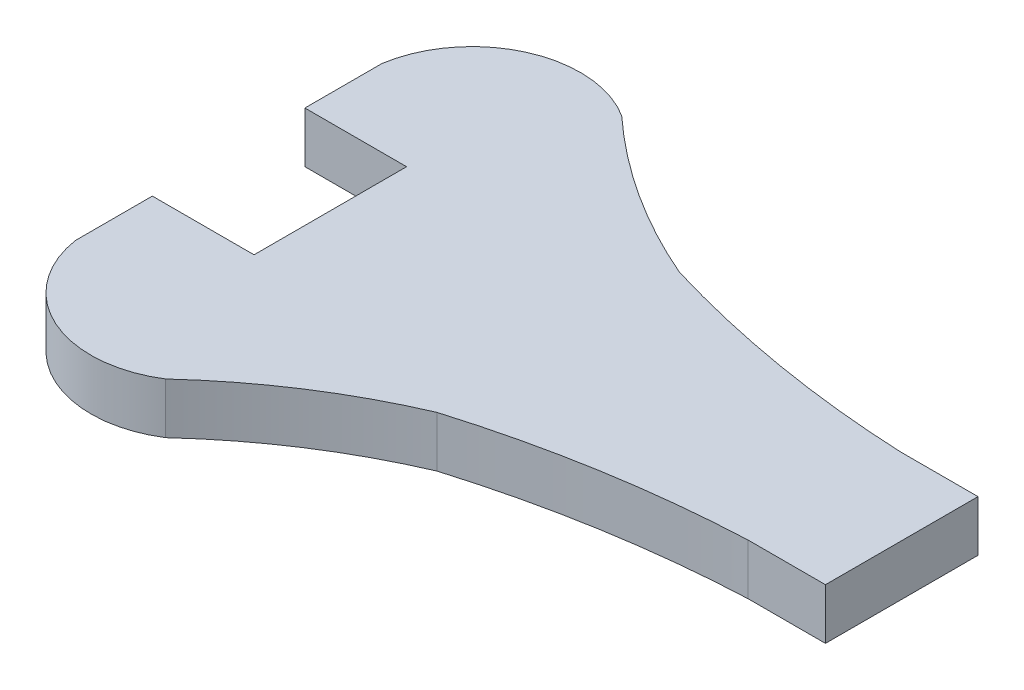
ISO-10303-21;
HEADER;
FILE_DESCRIPTION(('STEP AP214'),'2;1');
FILE_NAME('part.step','',(''),(''),'','','');
FILE_SCHEMA(('AUTOMOTIVE_DESIGN { 1 0 10303 214 1 1 1 1 }'));
ENDSEC;
DATA;
#1=APPLICATION_CONTEXT('core data for automotive mechanical design processes');
#2=APPLICATION_PROTOCOL_DEFINITION('international standard','automotive_design',2000,#1);
#3=PRODUCT_CONTEXT('',#1,'mechanical');
#4=PRODUCT('Part','Part','',(#3));
#5=PRODUCT_RELATED_PRODUCT_CATEGORY('part','',(#4));
#6=PRODUCT_DEFINITION_FORMATION('','',#4);
#7=PRODUCT_DEFINITION_CONTEXT('part definition',#1,'design');
#8=PRODUCT_DEFINITION('design','',#6,#7);
#9=PRODUCT_DEFINITION_SHAPE('','',#8);
#10=(LENGTH_UNIT() NAMED_UNIT(*) SI_UNIT(.MILLI.,.METRE.));
#11=(NAMED_UNIT(*) PLANE_ANGLE_UNIT() SI_UNIT($,.RADIAN.));
#12=(NAMED_UNIT(*) SI_UNIT($,.STERADIAN.) SOLID_ANGLE_UNIT());
#13=UNCERTAINTY_MEASURE_WITH_UNIT(LENGTH_MEASURE(1.E-05),#10,'distance_accuracy_value','');
#14=(GEOMETRIC_REPRESENTATION_CONTEXT(3) GLOBAL_UNCERTAINTY_ASSIGNED_CONTEXT((#13)) GLOBAL_UNIT_ASSIGNED_CONTEXT((#10,
#11,#12)) REPRESENTATION_CONTEXT('',''));
#15=CARTESIAN_POINT('',(0.,0.,0.));
#16=DIRECTION('',(0.,0.,1.));
#17=DIRECTION('',(1.,0.,0.));
#18=AXIS2_PLACEMENT_3D('',#15,#16,#17);
#19=CARTESIAN_POINT('',(13846.050556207,15.,-3171.60251170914));
#20=DIRECTION('',(0.,0.,-1.));
#21=DIRECTION('',(-1.,0.,0.));
#22=AXIS2_PLACEMENT_3D('',#19,#20,#21);
#23=PLANE('',#22);
#24=DIRECTION('',(1.,0.,0.));
#25=VECTOR('',#24,1.);
#26=CARTESIAN_POINT('',(13846.050556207,0.,-3171.60251170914));
#27=LINE('',#26,#25);
#28=CARTESIAN_POINT('',(13846.050556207,0.,-3171.60251170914));
#29=VERTEX_POINT('',#28);
#30=CARTESIAN_POINT('',(13876.050556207,0.,-3171.60251170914));
#31=VERTEX_POINT('',#30);
#32=EDGE_CURVE('E167',#29,#31,#27,.T.);
#33=ORIENTED_EDGE('',*,*,#32,.T.);
#34=DIRECTION('',(0.,-1.,0.));
#35=VECTOR('',#34,1.);
#36=CARTESIAN_POINT('',(13876.050556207,15.,-3171.60251170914));
#37=LINE('',#36,#35);
#38=CARTESIAN_POINT('',(13876.050556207,15.,-3171.60251170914));
#39=VERTEX_POINT('',#38);
#40=EDGE_CURVE('E11',#39,#31,#37,.T.);
#41=ORIENTED_EDGE('',*,*,#40,.F.);
#42=DIRECTION('',(1.,0.,0.));
#43=VECTOR('',#42,1.);
#44=CARTESIAN_POINT('',(13846.050556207,15.,-3171.60251170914));
#45=LINE('',#44,#43);
#46=CARTESIAN_POINT('',(13846.050556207,15.,-3171.60251170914));
#47=VERTEX_POINT('',#46);
#48=EDGE_CURVE('E193',#47,#39,#45,.T.);
#49=ORIENTED_EDGE('',*,*,#48,.F.);
#50=DIRECTION('',(0.,-1.,0.));
#51=VECTOR('',#50,1.);
#52=CARTESIAN_POINT('',(13846.050556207,15.,-3171.60251170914));
#53=LINE('',#52,#51);
#54=EDGE_CURVE('E163',#47,#29,#53,.T.);
#55=ORIENTED_EDGE('',*,*,#54,.T.);
#56=EDGE_LOOP('',(#33,#41,#49,#55));
#57=FACE_BOUND('',#56,.T.);
#58=ADVANCED_FACE('F35',(#57),#23,.F.);
#59=CARTESIAN_POINT('',(13876.050556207,15.,-3126.60251170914));
#60=DIRECTION('',(1.,0.,0.));
#61=DIRECTION('',(0.,0.,-1.));
#62=AXIS2_PLACEMENT_3D('',#59,#60,#61);
#63=PLANE('',#62);
#64=DIRECTION('',(0.,0.,1.));
#65=VECTOR('',#64,1.);
#66=CARTESIAN_POINT('',(13876.050556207,0.,-3126.60251170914));
#67=LINE('',#66,#65);
#68=CARTESIAN_POINT('',(13876.050556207,0.,-3126.60251170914));
#69=VERTEX_POINT('',#68);
#70=EDGE_CURVE('E170',#31,#69,#67,.T.);
#71=ORIENTED_EDGE('',*,*,#70,.T.);
#72=DIRECTION('',(0.,-1.,0.));
#73=VECTOR('',#72,1.);
#74=CARTESIAN_POINT('',(13876.050556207,15.,-3126.60251170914));
#75=LINE('',#74,#73);
#76=CARTESIAN_POINT('',(13876.050556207,15.,-3126.60251170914));
#77=VERTEX_POINT('',#76);
#78=EDGE_CURVE('E43',#77,#69,#75,.T.);
#79=ORIENTED_EDGE('',*,*,#78,.F.);
#80=DIRECTION('',(0.,0.,1.));
#81=VECTOR('',#80,1.);
#82=CARTESIAN_POINT('',(13876.050556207,15.,-3171.60251170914));
#83=LINE('',#82,#81);
#84=EDGE_CURVE('E112',#39,#77,#83,.T.);
#85=ORIENTED_EDGE('',*,*,#84,.F.);
#86=ORIENTED_EDGE('',*,*,#40,.T.);
#87=EDGE_LOOP('',(#71,#79,#85,#86));
#88=FACE_BOUND('',#87,.T.);
#89=ADVANCED_FACE('F281',(#88),#63,.F.);
#90=CARTESIAN_POINT('',(13846.050556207,15.,-3126.60251170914));
#91=DIRECTION('',(0.,0.,1.));
#92=DIRECTION('',(1.,0.,0.));
#93=AXIS2_PLACEMENT_3D('',#90,#91,#92);
#94=PLANE('',#93);
#95=DIRECTION('',(-1.,0.,0.));
#96=VECTOR('',#95,1.);
#97=CARTESIAN_POINT('',(13846.050556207,0.,-3126.60251170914));
#98=LINE('',#97,#96);
#99=CARTESIAN_POINT('',(13846.050556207,0.,-3126.60251170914));
#100=VERTEX_POINT('',#99);
#101=EDGE_CURVE('E172',#69,#100,#98,.T.);
#102=ORIENTED_EDGE('',*,*,#101,.T.);
#103=DIRECTION('',(0.,-1.,0.));
#104=VECTOR('',#103,1.);
#105=CARTESIAN_POINT('',(13846.050556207,15.,-3126.60251170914));
#106=LINE('',#105,#104);
#107=CARTESIAN_POINT('',(13846.050556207,15.,-3126.60251170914));
#108=VERTEX_POINT('',#107);
#109=EDGE_CURVE('E218',#108,#100,#106,.T.);
#110=ORIENTED_EDGE('',*,*,#109,.F.);
#111=DIRECTION('',(-1.,0.,0.));
#112=VECTOR('',#111,1.);
#113=CARTESIAN_POINT('',(13846.050556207,15.,-3126.60251170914));
#114=LINE('',#113,#112);
#115=EDGE_CURVE('E226',#77,#108,#114,.T.);
#116=ORIENTED_EDGE('',*,*,#115,.F.);
#117=ORIENTED_EDGE('',*,*,#78,.T.);
#118=EDGE_LOOP('',(#102,#110,#116,#117));
#119=FACE_BOUND('',#118,.T.);
#120=ADVANCED_FACE('F224',(#119),#94,.F.);
#121=CARTESIAN_POINT('',(13846.050556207,15.,-3126.60251170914));
#122=DIRECTION('',(1.,0.,0.));
#123=DIRECTION('',(0.,0.,-1.));
#124=AXIS2_PLACEMENT_3D('',#121,#122,#123);
#125=PLANE('',#124);
#126=DIRECTION('',(0.,0.,1.));
#127=VECTOR('',#126,1.);
#128=CARTESIAN_POINT('',(13846.050556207,0.,-3126.60251170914));
#129=LINE('',#128,#127);
#130=CARTESIAN_POINT('',(13846.050556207,0.,-3103.89129640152));
#131=VERTEX_POINT('',#130);
#132=EDGE_CURVE('E174',#100,#131,#129,.T.);
#133=ORIENTED_EDGE('',*,*,#132,.T.);
#134=DIRECTION('',(0.,-1.,0.));
#135=VECTOR('',#134,1.);
#136=CARTESIAN_POINT('',(13846.050556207,15.,-3103.89129640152));
#137=LINE('',#136,#135);
#138=CARTESIAN_POINT('',(13846.050556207,15.,-3103.89129640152));
#139=VERTEX_POINT('',#138);
#140=EDGE_CURVE('E215',#139,#131,#137,.T.);
#141=ORIENTED_EDGE('',*,*,#140,.F.);
#142=DIRECTION('',(0.,0.,1.));
#143=VECTOR('',#142,1.);
#144=CARTESIAN_POINT('',(13846.050556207,15.,-3126.60251170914));
#145=LINE('',#144,#143);
#146=EDGE_CURVE('E244',#108,#139,#145,.T.);
#147=ORIENTED_EDGE('',*,*,#146,.F.);
#148=ORIENTED_EDGE('',*,*,#109,.T.);
#149=EDGE_LOOP('',(#133,#141,#147,#148));
#150=FACE_BOUND('',#149,.T.);
#151=ADVANCED_FACE('F235',(#150),#125,.F.);
#152=CARTESIAN_POINT('',(13877.6260141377,15.,-3108.83569729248));
#153=DIRECTION('',(0.,-1.,0.));
#154=DIRECTION('',(0.,0.,-1.));
#155=AXIS2_PLACEMENT_3D('',#152,#153,#154);
#156=CYLINDRICAL_SURFACE('',#155,31.9602353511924);
#157=CARTESIAN_POINT('',(13877.6260141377,0.,-3108.83569729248));
#158=DIRECTION('',(0.,1.,0.));
#159=DIRECTION('',(0.,0.,1.));
#160=AXIS2_PLACEMENT_3D('',#157,#158,#159);
#161=CIRCLE('',#160,31.9602353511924);
#162=CARTESIAN_POINT('',(13894.7414302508,0.,-3081.84460292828));
#163=VERTEX_POINT('',#162);
#164=EDGE_CURVE('E176',#131,#163,#161,.T.);
#165=ORIENTED_EDGE('',*,*,#164,.T.);
#166=DIRECTION('',(0.,-1.,0.));
#167=VECTOR('',#166,1.);
#168=CARTESIAN_POINT('',(13894.7414302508,15.,-3081.84460292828));
#169=LINE('',#168,#167);
#170=CARTESIAN_POINT('',(13894.7414302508,15.,-3081.84460292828));
#171=VERTEX_POINT('',#170);
#172=EDGE_CURVE('E212',#171,#163,#169,.T.);
#173=ORIENTED_EDGE('',*,*,#172,.F.);
#174=CARTESIAN_POINT('',(13877.6260141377,15.,-3108.83569729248));
#175=DIRECTION('',(0.,1.,0.));
#176=DIRECTION('',(0.,0.,1.));
#177=AXIS2_PLACEMENT_3D('',#174,#175,#176);
#178=CIRCLE('',#177,31.9602353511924);
#179=EDGE_CURVE('E241',#139,#171,#178,.T.);
#180=ORIENTED_EDGE('',*,*,#179,.F.);
#181=ORIENTED_EDGE('',*,*,#140,.T.);
#182=EDGE_LOOP('',(#165,#173,#180,#181));
#183=FACE_BOUND('',#182,.T.);
#184=ADVANCED_FACE('F239',(#183),#156,.T.);
#185=CARTESIAN_POINT('',(14010.9900041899,15.,-2955.7284521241));
#186=DIRECTION('',(0.,-1.,0.));
#187=DIRECTION('',(0.,0.,-1.));
#188=AXIS2_PLACEMENT_3D('',#185,#186,#187);
#189=CYLINDRICAL_SURFACE('',#188,171.519720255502);
#190=CARTESIAN_POINT('',(14010.9900041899,0.,-2955.7284521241));
#191=DIRECTION('',(0.,-1.,0.));
#192=DIRECTION('',(0.,0.,1.));
#193=AXIS2_PLACEMENT_3D('',#190,#191,#192);
#194=CIRCLE('',#193,171.519720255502);
#195=CARTESIAN_POINT('',(13943.3010378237,0.,-3113.32673342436));
#196=VERTEX_POINT('',#195);
#197=EDGE_CURVE('E178',#163,#196,#194,.T.);
#198=ORIENTED_EDGE('',*,*,#197,.T.);
#199=DIRECTION('',(0.,-1.,0.));
#200=VECTOR('',#199,1.);
#201=CARTESIAN_POINT('',(13943.3010378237,15.,-3113.32673342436));
#202=LINE('',#201,#200);
#203=CARTESIAN_POINT('',(13943.3010378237,15.,-3113.32673342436));
#204=VERTEX_POINT('',#203);
#205=EDGE_CURVE('E209',#204,#196,#202,.T.);
#206=ORIENTED_EDGE('',*,*,#205,.F.);
#207=CARTESIAN_POINT('',(14010.9900041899,15.,-2955.7284521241));
#208=DIRECTION('',(0.,-1.,0.));
#209=DIRECTION('',(0.,0.,1.));
#210=AXIS2_PLACEMENT_3D('',#207,#208,#209);
#211=CIRCLE('',#210,171.519720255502);
#212=EDGE_CURVE('E243',#171,#204,#211,.T.);
#213=ORIENTED_EDGE('',*,*,#212,.F.);
#214=ORIENTED_EDGE('',*,*,#172,.T.);
#215=EDGE_LOOP('',(#198,#206,#213,#214));
#216=FACE_BOUND('',#215,.T.);
#217=ADVANCED_FACE('F294',(#216),#189,.F.);
#218=CARTESIAN_POINT('',(14036.0375291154,15.,-2803.75169070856));
#219=DIRECTION('',(0.,-1.,0.));
#220=DIRECTION('',(0.,0.,-1.));
#221=AXIS2_PLACEMENT_3D('',#218,#219,#220);
#222=CYLINDRICAL_SURFACE('',#221,323.166774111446);
#223=CARTESIAN_POINT('',(14036.0375291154,0.,-2803.75169070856));
#224=DIRECTION('',(0.,-1.,0.));
#225=DIRECTION('',(0.,0.,1.));
#226=AXIS2_PLACEMENT_3D('',#223,#224,#225);
#227=CIRCLE('',#226,323.166774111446);
#228=CARTESIAN_POINT('',(14021.7507776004,0.,-3126.60251170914));
#229=VERTEX_POINT('',#228);
#230=EDGE_CURVE('E180',#196,#229,#227,.T.);
#231=ORIENTED_EDGE('',*,*,#230,.T.);
#232=DIRECTION('',(0.,-1.,0.));
#233=VECTOR('',#232,1.);
#234=CARTESIAN_POINT('',(14021.7507776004,15.,-3126.60251170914));
#235=LINE('',#234,#233);
#236=CARTESIAN_POINT('',(14021.7507776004,15.,-3126.60251170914));
#237=VERTEX_POINT('',#236);
#238=EDGE_CURVE('E206',#237,#229,#235,.T.);
#239=ORIENTED_EDGE('',*,*,#238,.F.);
#240=CARTESIAN_POINT('',(14036.0375291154,15.,-2803.75169070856));
#241=DIRECTION('',(0.,-1.,0.));
#242=DIRECTION('',(0.,0.,1.));
#243=AXIS2_PLACEMENT_3D('',#240,#241,#242);
#244=CIRCLE('',#243,323.166774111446);
#245=EDGE_CURVE('E246',#204,#237,#244,.T.);
#246=ORIENTED_EDGE('',*,*,#245,.F.);
#247=ORIENTED_EDGE('',*,*,#205,.T.);
#248=EDGE_LOOP('',(#231,#239,#246,#247));
#249=FACE_BOUND('',#248,.T.);
#250=ADVANCED_FACE('F297',(#249),#222,.F.);
#251=CARTESIAN_POINT('',(14021.7507776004,15.,-3126.60251170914));
#252=DIRECTION('',(0.,0.,-1.));
#253=DIRECTION('',(-1.,0.,0.));
#254=AXIS2_PLACEMENT_3D('',#251,#252,#253);
#255=PLANE('',#254);
#256=DIRECTION('',(1.,0.,0.));
#257=VECTOR('',#256,1.);
#258=CARTESIAN_POINT('',(14021.7507776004,0.,-3126.60251170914));
#259=LINE('',#258,#257);
#260=CARTESIAN_POINT('',(14044.6104545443,0.,-3126.60251170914));
#261=VERTEX_POINT('',#260);
#262=EDGE_CURVE('E182',#229,#261,#259,.T.);
#263=ORIENTED_EDGE('',*,*,#262,.T.);
#264=DIRECTION('',(0.,-1.,0.));
#265=VECTOR('',#264,1.);
#266=CARTESIAN_POINT('',(14044.6104545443,15.,-3126.60251170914));
#267=LINE('',#266,#265);
#268=CARTESIAN_POINT('',(14044.6104545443,15.,-3126.60251170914));
#269=VERTEX_POINT('',#268);
#270=EDGE_CURVE('E203',#269,#261,#267,.T.);
#271=ORIENTED_EDGE('',*,*,#270,.F.);
#272=DIRECTION('',(1.,0.,0.));
#273=VECTOR('',#272,1.);
#274=CARTESIAN_POINT('',(14021.7507776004,15.,-3126.60251170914));
#275=LINE('',#274,#273);
#276=EDGE_CURVE('E252',#237,#269,#275,.T.);
#277=ORIENTED_EDGE('',*,*,#276,.F.);
#278=ORIENTED_EDGE('',*,*,#238,.T.);
#279=EDGE_LOOP('',(#263,#271,#277,#278));
#280=FACE_BOUND('',#279,.T.);
#281=ADVANCED_FACE('F301',(#280),#255,.F.);
#282=CARTESIAN_POINT('',(14044.6104545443,15.,-3171.60251170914));
#283=DIRECTION('',(-1.,0.,0.));
#284=DIRECTION('',(0.,0.,1.));
#285=AXIS2_PLACEMENT_3D('',#282,#283,#284);
#286=PLANE('',#285);
#287=DIRECTION('',(0.,0.,-1.));
#288=VECTOR('',#287,1.);
#289=CARTESIAN_POINT('',(14044.6104545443,0.,-3171.60251170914));
#290=LINE('',#289,#288);
#291=CARTESIAN_POINT('',(14044.6104545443,0.,-3171.60251170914));
#292=VERTEX_POINT('',#291);
#293=EDGE_CURVE('E184',#261,#292,#290,.T.);
#294=ORIENTED_EDGE('',*,*,#293,.T.);
#295=DIRECTION('',(0.,-1.,0.));
#296=VECTOR('',#295,1.);
#297=CARTESIAN_POINT('',(14044.6104545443,15.,-3171.60251170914));
#298=LINE('',#297,#296);
#299=CARTESIAN_POINT('',(14044.6104545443,15.,-3171.60251170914));
#300=VERTEX_POINT('',#299);
#301=EDGE_CURVE('E200',#300,#292,#298,.T.);
#302=ORIENTED_EDGE('',*,*,#301,.F.);
#303=DIRECTION('',(0.,0.,-1.));
#304=VECTOR('',#303,1.);
#305=CARTESIAN_POINT('',(14044.6104545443,15.,-3171.60251170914));
#306=LINE('',#305,#304);
#307=EDGE_CURVE('E254',#269,#300,#306,.T.);
#308=ORIENTED_EDGE('',*,*,#307,.F.);
#309=ORIENTED_EDGE('',*,*,#270,.T.);
#310=EDGE_LOOP('',(#294,#302,#308,#309));
#311=FACE_BOUND('',#310,.T.);
#312=ADVANCED_FACE('F305',(#311),#286,.F.);
#313=CARTESIAN_POINT('',(14021.7507776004,15.,-3171.60251170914));
#314=DIRECTION('',(0.,0.,1.));
#315=DIRECTION('',(1.,0.,0.));
#316=AXIS2_PLACEMENT_3D('',#313,#314,#315);
#317=PLANE('',#316);
#318=DIRECTION('',(-1.,0.,0.));
#319=VECTOR('',#318,1.);
#320=CARTESIAN_POINT('',(14021.7507776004,0.,-3171.60251170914));
#321=LINE('',#320,#319);
#322=CARTESIAN_POINT('',(14021.7507776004,0.,-3171.60251170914));
#323=VERTEX_POINT('',#322);
#324=EDGE_CURVE('E186',#292,#323,#321,.T.);
#325=ORIENTED_EDGE('',*,*,#324,.T.);
#326=DIRECTION('',(0.,-1.,0.));
#327=VECTOR('',#326,1.);
#328=CARTESIAN_POINT('',(14021.7507776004,15.,-3171.60251170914));
#329=LINE('',#328,#327);
#330=CARTESIAN_POINT('',(14021.7507776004,15.,-3171.60251170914));
#331=VERTEX_POINT('',#330);
#332=EDGE_CURVE('E197',#331,#323,#329,.T.);
#333=ORIENTED_EDGE('',*,*,#332,.F.);
#334=DIRECTION('',(-1.,0.,0.));
#335=VECTOR('',#334,1.);
#336=CARTESIAN_POINT('',(14021.7507776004,15.,-3171.60251170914));
#337=LINE('',#336,#335);
#338=EDGE_CURVE('E256',#300,#331,#337,.T.);
#339=ORIENTED_EDGE('',*,*,#338,.F.);
#340=ORIENTED_EDGE('',*,*,#301,.T.);
#341=EDGE_LOOP('',(#325,#333,#339,#340));
#342=FACE_BOUND('',#341,.T.);
#343=ADVANCED_FACE('F262',(#342),#317,.F.);
#344=CARTESIAN_POINT('',(14036.0375291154,15.,-3494.45333270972));
#345=DIRECTION('',(0.,-1.,0.));
#346=DIRECTION('',(0.,0.,-1.));
#347=AXIS2_PLACEMENT_3D('',#344,#345,#346);
#348=CYLINDRICAL_SURFACE('',#347,323.166774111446);
#349=CARTESIAN_POINT('',(14036.0375291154,0.,-3494.45333270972));
#350=DIRECTION('',(0.,-1.,0.));
#351=DIRECTION('',(0.,0.,1.));
#352=AXIS2_PLACEMENT_3D('',#349,#350,#351);
#353=CIRCLE('',#352,323.166774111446);
#354=CARTESIAN_POINT('',(13943.3010378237,0.,-3184.87828999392));
#355=VERTEX_POINT('',#354);
#356=EDGE_CURVE('E188',#323,#355,#353,.T.);
#357=ORIENTED_EDGE('',*,*,#356,.T.);
#358=DIRECTION('',(0.,-1.,0.));
#359=VECTOR('',#358,1.);
#360=CARTESIAN_POINT('',(13943.3010378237,15.,-3184.87828999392));
#361=LINE('',#360,#359);
#362=CARTESIAN_POINT('',(13943.3010378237,15.,-3184.87828999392));
#363=VERTEX_POINT('',#362);
#364=EDGE_CURVE('E158',#363,#355,#361,.T.);
#365=ORIENTED_EDGE('',*,*,#364,.F.);
#366=CARTESIAN_POINT('',(14036.0375291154,15.,-3494.45333270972));
#367=DIRECTION('',(0.,-1.,0.));
#368=DIRECTION('',(0.,0.,1.));
#369=AXIS2_PLACEMENT_3D('',#366,#367,#368);
#370=CIRCLE('',#369,323.166774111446);
#371=EDGE_CURVE('E149',#331,#363,#370,.T.);
#372=ORIENTED_EDGE('',*,*,#371,.F.);
#373=ORIENTED_EDGE('',*,*,#332,.T.);
#374=EDGE_LOOP('',(#357,#365,#372,#373));
#375=FACE_BOUND('',#374,.T.);
#376=ADVANCED_FACE('F266',(#375),#348,.F.);
#377=CARTESIAN_POINT('',(14010.9900041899,15.,-3342.47657129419));
#378=DIRECTION('',(0.,-1.,0.));
#379=DIRECTION('',(0.,0.,-1.));
#380=AXIS2_PLACEMENT_3D('',#377,#378,#379);
#381=CYLINDRICAL_SURFACE('',#380,171.519720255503);
#382=CARTESIAN_POINT('',(14010.9900041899,0.,-3342.47657129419));
#383=DIRECTION('',(0.,-1.,0.));
#384=DIRECTION('',(0.,0.,1.));
#385=AXIS2_PLACEMENT_3D('',#382,#383,#384);
#386=CIRCLE('',#385,171.519720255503);
#387=CARTESIAN_POINT('',(13894.7414302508,0.,-3216.36042049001));
#388=VERTEX_POINT('',#387);
#389=EDGE_CURVE('E157',#355,#388,#386,.T.);
#390=ORIENTED_EDGE('',*,*,#389,.T.);
#391=DIRECTION('',(0.,-1.,0.));
#392=VECTOR('',#391,1.);
#393=CARTESIAN_POINT('',(13894.7414302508,15.,-3216.36042049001));
#394=LINE('',#393,#392);
#395=CARTESIAN_POINT('',(13894.7414302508,15.,-3216.36042049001));
#396=VERTEX_POINT('',#395);
#397=EDGE_CURVE('E154',#396,#388,#394,.T.);
#398=ORIENTED_EDGE('',*,*,#397,.F.);
#399=CARTESIAN_POINT('',(14010.9900041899,15.,-3342.47657129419));
#400=DIRECTION('',(0.,-1.,0.));
#401=DIRECTION('',(0.,0.,1.));
#402=AXIS2_PLACEMENT_3D('',#399,#400,#401);
#403=CIRCLE('',#402,171.519720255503);
#404=EDGE_CURVE('E143',#363,#396,#403,.T.);
#405=ORIENTED_EDGE('',*,*,#404,.F.);
#406=ORIENTED_EDGE('',*,*,#364,.T.);
#407=EDGE_LOOP('',(#390,#398,#405,#406));
#408=FACE_BOUND('',#407,.T.);
#409=ADVANCED_FACE('F155',(#408),#381,.F.);
#410=CARTESIAN_POINT('',(13877.6260141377,15.,-3189.3693261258));
#411=DIRECTION('',(0.,-1.,0.));
#412=DIRECTION('',(0.,0.,-1.));
#413=AXIS2_PLACEMENT_3D('',#410,#411,#412);
#414=CYLINDRICAL_SURFACE('',#413,31.9602353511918);
#415=CARTESIAN_POINT('',(13877.6260141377,0.,-3189.3693261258));
#416=DIRECTION('',(0.,1.,0.));
#417=DIRECTION('',(0.,0.,1.));
#418=AXIS2_PLACEMENT_3D('',#415,#416,#417);
#419=CIRCLE('',#418,31.9602353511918);
#420=CARTESIAN_POINT('',(13846.050556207,0.,-3194.31372701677));
#421=VERTEX_POINT('',#420);
#422=EDGE_CURVE('E98',#388,#421,#419,.T.);
#423=ORIENTED_EDGE('',*,*,#422,.T.);
#424=DIRECTION('',(0.,-1.,0.));
#425=VECTOR('',#424,1.);
#426=CARTESIAN_POINT('',(13846.050556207,15.,-3194.31372701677));
#427=LINE('',#426,#425);
#428=CARTESIAN_POINT('',(13846.050556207,15.,-3194.31372701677));
#429=VERTEX_POINT('',#428);
#430=EDGE_CURVE('E159',#429,#421,#427,.T.);
#431=ORIENTED_EDGE('',*,*,#430,.F.);
#432=CARTESIAN_POINT('',(13877.6260141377,15.,-3189.3693261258));
#433=DIRECTION('',(0.,1.,0.));
#434=DIRECTION('',(0.,0.,1.));
#435=AXIS2_PLACEMENT_3D('',#432,#433,#434);
#436=CIRCLE('',#435,31.9602353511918);
#437=EDGE_CURVE('E147',#396,#429,#436,.T.);
#438=ORIENTED_EDGE('',*,*,#437,.F.);
#439=ORIENTED_EDGE('',*,*,#397,.T.);
#440=EDGE_LOOP('',(#423,#431,#438,#439));
#441=FACE_BOUND('',#440,.T.);
#442=ADVANCED_FACE('F161',(#441),#414,.T.);
#443=CARTESIAN_POINT('',(13846.050556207,15.,-3171.60251170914));
#444=DIRECTION('',(1.,0.,0.));
#445=DIRECTION('',(0.,0.,-1.));
#446=AXIS2_PLACEMENT_3D('',#443,#444,#445);
#447=PLANE('',#446);
#448=DIRECTION('',(0.,0.,1.));
#449=VECTOR('',#448,1.);
#450=CARTESIAN_POINT('',(13846.050556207,0.,-3171.60251170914));
#451=LINE('',#450,#449);
#452=EDGE_CURVE('E104',#421,#29,#451,.T.);
#453=ORIENTED_EDGE('',*,*,#452,.T.);
#454=ORIENTED_EDGE('',*,*,#54,.F.);
#455=DIRECTION('',(0.,0.,1.));
#456=VECTOR('',#455,1.);
#457=CARTESIAN_POINT('',(13846.050556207,15.,-3171.60251170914));
#458=LINE('',#457,#456);
#459=EDGE_CURVE('E51',#429,#47,#458,.T.);
#460=ORIENTED_EDGE('',*,*,#459,.F.);
#461=ORIENTED_EDGE('',*,*,#430,.T.);
#462=EDGE_LOOP('',(#453,#454,#460,#461));
#463=FACE_BOUND('',#462,.T.);
#464=ADVANCED_FACE('F270',(#463),#447,.F.);
#465=CARTESIAN_POINT('',(13877.6260141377,15.,-3108.83569729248));
#466=DIRECTION('',(0.,1.,0.));
#467=DIRECTION('',(0.,0.,1.));
#468=AXIS2_PLACEMENT_3D('',#465,#466,#467);
#469=PLANE('',#468);
#470=ORIENTED_EDGE('',*,*,#48,.T.);
#471=ORIENTED_EDGE('',*,*,#84,.T.);
#472=ORIENTED_EDGE('',*,*,#115,.T.);
#473=ORIENTED_EDGE('',*,*,#146,.T.);
#474=ORIENTED_EDGE('',*,*,#179,.T.);
#475=ORIENTED_EDGE('',*,*,#212,.T.);
#476=ORIENTED_EDGE('',*,*,#245,.T.);
#477=ORIENTED_EDGE('',*,*,#276,.T.);
#478=ORIENTED_EDGE('',*,*,#307,.T.);
#479=ORIENTED_EDGE('',*,*,#338,.T.);
#480=ORIENTED_EDGE('',*,*,#371,.T.);
#481=ORIENTED_EDGE('',*,*,#404,.T.);
#482=ORIENTED_EDGE('',*,*,#437,.T.);
#483=ORIENTED_EDGE('',*,*,#459,.T.);
#484=EDGE_LOOP('',(#470,#471,#472,#473,#474,#475,#476,#477,#478,#479,#480,#481,#482,#483));
#485=FACE_BOUND('',#484,.T.);
#486=ADVANCED_FACE('F145',(#485),#469,.T.);
#487=CARTESIAN_POINT('',(13877.6260141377,0.,-3108.83569729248));
#488=DIRECTION('',(0.,1.,0.));
#489=DIRECTION('',(0.,0.,1.));
#490=AXIS2_PLACEMENT_3D('',#487,#488,#489);
#491=PLANE('',#490);
#492=ORIENTED_EDGE('',*,*,#32,.F.);
#493=ORIENTED_EDGE('',*,*,#452,.F.);
#494=ORIENTED_EDGE('',*,*,#422,.F.);
#495=ORIENTED_EDGE('',*,*,#389,.F.);
#496=ORIENTED_EDGE('',*,*,#356,.F.);
#497=ORIENTED_EDGE('',*,*,#324,.F.);
#498=ORIENTED_EDGE('',*,*,#293,.F.);
#499=ORIENTED_EDGE('',*,*,#262,.F.);
#500=ORIENTED_EDGE('',*,*,#230,.F.);
#501=ORIENTED_EDGE('',*,*,#197,.F.);
#502=ORIENTED_EDGE('',*,*,#164,.F.);
#503=ORIENTED_EDGE('',*,*,#132,.F.);
#504=ORIENTED_EDGE('',*,*,#101,.F.);
#505=ORIENTED_EDGE('',*,*,#70,.F.);
#506=EDGE_LOOP('',(#492,#493,#494,#495,#496,#497,#498,#499,#500,#501,#502,#503,#504,#505));
#507=FACE_BOUND('',#506,.T.);
#508=ADVANCED_FACE('F230',(#507),#491,.F.);
#509=CLOSED_SHELL('',(#58,#89,#120,#151,#184,#217,#250,#281,#312,#343,#376,#409,#442,#464,#486,#508));
#510=MANIFOLD_SOLID_BREP('B2',#509);
#511=ADVANCED_BREP_SHAPE_REPRESENTATION('',(#18,#510),#14);
#512=SHAPE_DEFINITION_REPRESENTATION(#9,#511);
ENDSEC;
END-ISO-10303-21;
